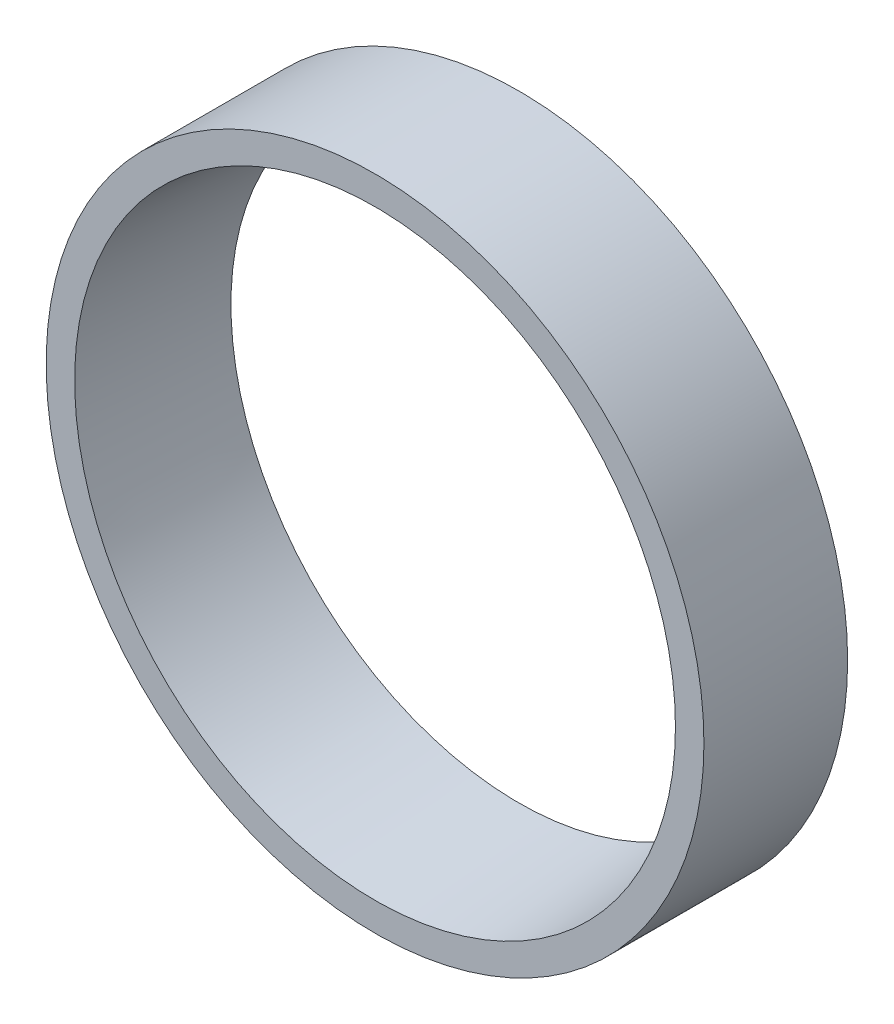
ISO-10303-21;
HEADER;
FILE_DESCRIPTION(('STEP AP214'),'2;1');
FILE_NAME('part.step','',(''),(''),'','','');
FILE_SCHEMA(('AUTOMOTIVE_DESIGN { 1 0 10303 214 1 1 1 1 }'));
ENDSEC;
DATA;
#1=APPLICATION_CONTEXT('core data for automotive mechanical design processes');
#2=APPLICATION_PROTOCOL_DEFINITION('international standard','automotive_design',2000,#1);
#3=PRODUCT_CONTEXT('',#1,'mechanical');
#4=PRODUCT('Part','Part','',(#3));
#5=PRODUCT_RELATED_PRODUCT_CATEGORY('part','',(#4));
#6=PRODUCT_DEFINITION_FORMATION('','',#4);
#7=PRODUCT_DEFINITION_CONTEXT('part definition',#1,'design');
#8=PRODUCT_DEFINITION('design','',#6,#7);
#9=PRODUCT_DEFINITION_SHAPE('','',#8);
#10=(LENGTH_UNIT() NAMED_UNIT(*) SI_UNIT(.MILLI.,.METRE.));
#11=(NAMED_UNIT(*) PLANE_ANGLE_UNIT() SI_UNIT($,.RADIAN.));
#12=(NAMED_UNIT(*) SI_UNIT($,.STERADIAN.) SOLID_ANGLE_UNIT());
#13=UNCERTAINTY_MEASURE_WITH_UNIT(LENGTH_MEASURE(1.E-05),#10,'distance_accuracy_value','');
#14=(GEOMETRIC_REPRESENTATION_CONTEXT(3) GLOBAL_UNCERTAINTY_ASSIGNED_CONTEXT((#13)) GLOBAL_UNIT_ASSIGNED_CONTEXT((#10,
#11,#12)) REPRESENTATION_CONTEXT('',''));
#15=CARTESIAN_POINT('',(0.,0.,0.));
#16=DIRECTION('',(0.,0.,1.));
#17=DIRECTION('',(1.,0.,0.));
#18=AXIS2_PLACEMENT_3D('',#15,#16,#17);
#19=CARTESIAN_POINT('',(0.,0.,-416.36831249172));
#20=DIRECTION('',(0.,0.,1.));
#21=DIRECTION('',(1.,0.,0.));
#22=AXIS2_PLACEMENT_3D('',#19,#20,#21);
#23=CYLINDRICAL_SURFACE('',#22,80.1);
#24=CARTESIAN_POINT('',(0.,0.,-189.81129979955));
#25=DIRECTION('',(0.,0.,1.));
#26=DIRECTION('',(1.,0.,0.));
#27=AXIS2_PLACEMENT_3D('',#24,#25,#26);
#28=CIRCLE('',#27,80.1);
#29=CARTESIAN_POINT('',(80.1,0.,-189.81129979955));
#30=VERTEX_POINT('',#29);
#31=EDGE_CURVE('E10',#30,#30,#28,.F.);
#32=ORIENTED_EDGE('',*,*,#31,.F.);
#33=EDGE_LOOP('',(#32));
#34=FACE_BOUND('',#33,.T.);
#35=CARTESIAN_POINT('',(0.,0.,-154.81129979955));
#36=DIRECTION('',(0.,0.,1.));
#37=DIRECTION('',(1.,0.,0.));
#38=AXIS2_PLACEMENT_3D('',#35,#36,#37);
#39=CIRCLE('',#38,80.1);
#40=CARTESIAN_POINT('',(80.1,0.,-154.81129979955));
#41=VERTEX_POINT('',#40);
#42=EDGE_CURVE('E44',#41,#41,#39,.T.);
#43=ORIENTED_EDGE('',*,*,#42,.F.);
#44=EDGE_LOOP('',(#43));
#45=FACE_BOUND('',#44,.T.);
#46=ADVANCED_FACE('F31',(#34,#45),#23,.T.);
#47=CARTESIAN_POINT('',(0.,0.,-154.81129979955));
#48=DIRECTION('',(0.,0.,1.));
#49=DIRECTION('',(1.,0.,0.));
#50=AXIS2_PLACEMENT_3D('',#47,#48,#49);
#51=PLANE('',#50);
#52=CARTESIAN_POINT('',(0.,0.,-154.81129979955));
#53=DIRECTION('',(0.,0.,1.));
#54=DIRECTION('',(1.,0.,0.));
#55=AXIS2_PLACEMENT_3D('',#52,#53,#54);
#56=CIRCLE('',#55,73.1621032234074);
#57=CARTESIAN_POINT('',(73.1621032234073,0.,-154.81129979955));
#58=VERTEX_POINT('',#57);
#59=EDGE_CURVE('E35',#58,#58,#56,.T.);
#60=ORIENTED_EDGE('',*,*,#59,.F.);
#61=EDGE_LOOP('',(#60));
#62=FACE_BOUND('',#61,.T.);
#63=ORIENTED_EDGE('',*,*,#42,.T.);
#64=EDGE_LOOP('',(#63));
#65=FACE_BOUND('',#64,.T.);
#66=ADVANCED_FACE('F53',(#62,#65),#51,.T.);
#67=CARTESIAN_POINT('',(0.,0.,-189.81129979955));
#68=DIRECTION('',(0.,0.,1.));
#69=DIRECTION('',(1.,0.,0.));
#70=AXIS2_PLACEMENT_3D('',#67,#68,#69);
#71=CONICAL_SURFACE('',#70,70.1,0.0872664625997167);
#72=CARTESIAN_POINT('',(0.,0.,-189.81129979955));
#73=DIRECTION('',(0.,0.,1.));
#74=DIRECTION('',(1.,0.,0.));
#75=AXIS2_PLACEMENT_3D('',#72,#73,#74);
#76=CIRCLE('',#75,70.1);
#77=CARTESIAN_POINT('',(70.1,0.,-189.81129979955));
#78=VERTEX_POINT('',#77);
#79=EDGE_CURVE('E39',#78,#78,#76,.F.);
#80=ORIENTED_EDGE('',*,*,#79,.T.);
#81=EDGE_LOOP('',(#80));
#82=FACE_BOUND('',#81,.T.);
#83=ORIENTED_EDGE('',*,*,#59,.T.);
#84=EDGE_LOOP('',(#83));
#85=FACE_BOUND('',#84,.T.);
#86=ADVANCED_FACE('F33',(#82,#85),#71,.F.);
#87=CARTESIAN_POINT('',(1.93185228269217E-13,0.,-189.81129979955));
#88=DIRECTION('',(0.,0.,1.));
#89=DIRECTION('',(-0.964499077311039,-0.264086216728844,0.));
#90=AXIS2_PLACEMENT_3D('',#87,#88,#89);
#91=PLANE('',#90);
#92=ORIENTED_EDGE('',*,*,#31,.T.);
#93=EDGE_LOOP('',(#92));
#94=FACE_BOUND('',#93,.T.);
#95=ORIENTED_EDGE('',*,*,#79,.F.);
#96=EDGE_LOOP('',(#95));
#97=FACE_BOUND('',#96,.T.);
#98=ADVANCED_FACE('F60',(#94,#97),#91,.F.);
#99=CLOSED_SHELL('',(#46,#66,#86,#98));
#100=MANIFOLD_SOLID_BREP('B2',#99);
#101=ADVANCED_BREP_SHAPE_REPRESENTATION('',(#18,#100),#14);
#102=SHAPE_DEFINITION_REPRESENTATION(#9,#101);
ENDSEC;
END-ISO-10303-21;
